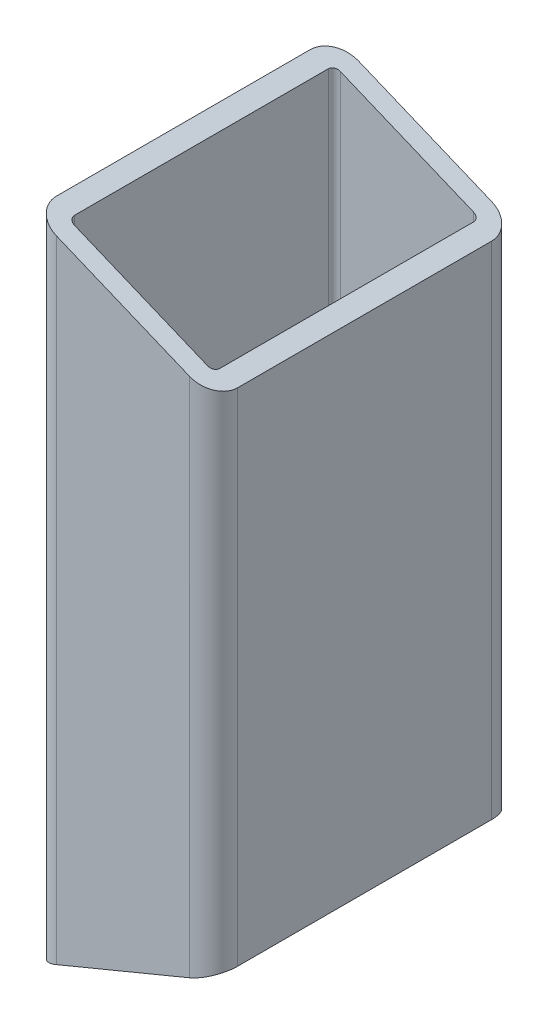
from build123d import *

# Parameters (mm, degrees)
BOSS_EXTRU_1_DEPTH = 3
BOSS_EXTRU_2_DEPTH = 44
BOSS_EXTRU_3_DEPTH = 44
BOSS_EXTRU_4_DEPTH = 3
CONG_1_R           = 1
CONG_2_R           = 4


with BuildPart() as part:
    # Esquisse1 → Boss.-Extru.1 (new body)
    with BuildSketch(Plane.XY.offset(25)):
        Polygon((-15, -53.85), (15, -41.423593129), (15, 41.423593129), (-15, 53.85), align=None)
    extrude(amount=-BOSS_EXTRU_1_DEPTH)

    # Esquisse2 → Boss.-Extru.2 (add)
    with BuildSketch(Plane(origin=(0, 0, 22), x_dir=(-1, 0, 0), z_dir=(0, 0, -1))):
        Polygon((-15, 41.423593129), (-12, 42.666233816), (-12, -42.666233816), (-15, -41.423593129), align=None)
    extrude(amount=BOSS_EXTRU_2_DEPTH)

    # Esquisse3 → Boss.-Extru.3 (add)
    with BuildSketch(Plane(origin=(0, 0, 22), x_dir=(-1, 0, 0), z_dir=(0, 0, -1))):
        Polygon((15, -53.85), (12, -52.607359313), (12, 52.607359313), (15, 53.85), align=None)
    extrude(amount=BOSS_EXTRU_3_DEPTH)

    # Esquisse4 → Boss.-Extru.4 (add)
    with BuildSketch(Plane(origin=(0, 0, -22), x_dir=(-1, 0, 0), z_dir=(0, 0, -1))):
        Polygon((15, -53.85), (-15, -41.423593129), (-15, 41.423593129), (15, 53.85), align=None)
    extrude(amount=BOSS_EXTRU_4_DEPTH)

    # Cong_1
    cong_1_edges = [part.edges().sort_by_distance(p)[0] for p in [
        (12, 0, -22),
        (12, 0, 22),
        (-12, 0, -22),
        (-12, 0, 22),
    ]]
    fillet(cong_1_edges, radius=CONG_1_R)

    # Cong_2
    cong_2_edges = [part.edges().sort_by_distance(p)[0] for p in [
        (-15, 0, -25),
        (15, 0, -25),
        (15, 0, 25),
        (-15, 0, 25),
    ]]
    fillet(cong_2_edges, radius=CONG_2_R)


solid = part.part
